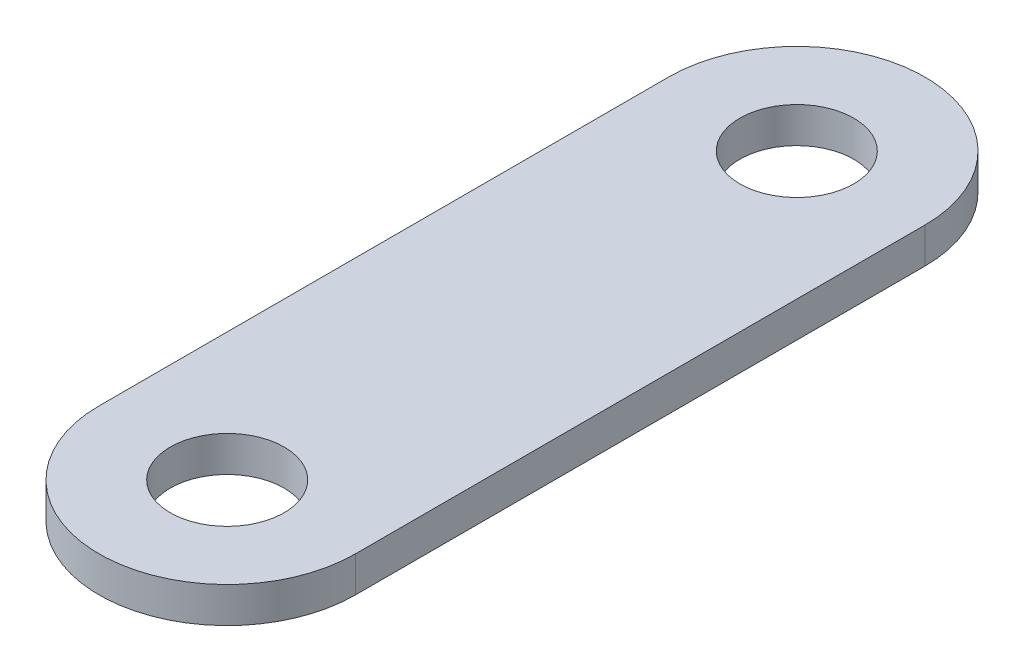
from build123d import *

# Parameters (mm, degrees)
SKETCH1_R           = 1.6
BOSS_EXTRUDE1_DEPTH = 1


with BuildPart() as part:
    # Sketch1 → Boss-Extrude1 (new body)
    with BuildSketch(Plane(origin=(0, 0, 0), x_dir=(1, 0, 0), z_dir=(0, 1, 0))):
        with BuildLine():
            Line((-3.6, 8), (-3.6, 0))
            Line((-3.6, 0), (3.6, 0))
            Line((3.6, 0), (3.6, 8))
            ThreePointArc((3.6, 8), (0, 11.6), (-3.6, 8))
        make_face()
        with Locations(Location((0, 8, 0), (0, 0, 270))):
            Circle(SKETCH1_R, mode=Mode.SUBTRACT)
    extrude(amount=BOSS_EXTRUDE1_DEPTH)

    # Mirror1: part across plane


with BuildPart() as part_1:
    add(part.part)
    add(part.part.mirror(Plane(origin=(-3.6, 1, 0), x_dir=(1, 0, 0), z_dir=(0, 0, -1))))


solid = part_1.part
